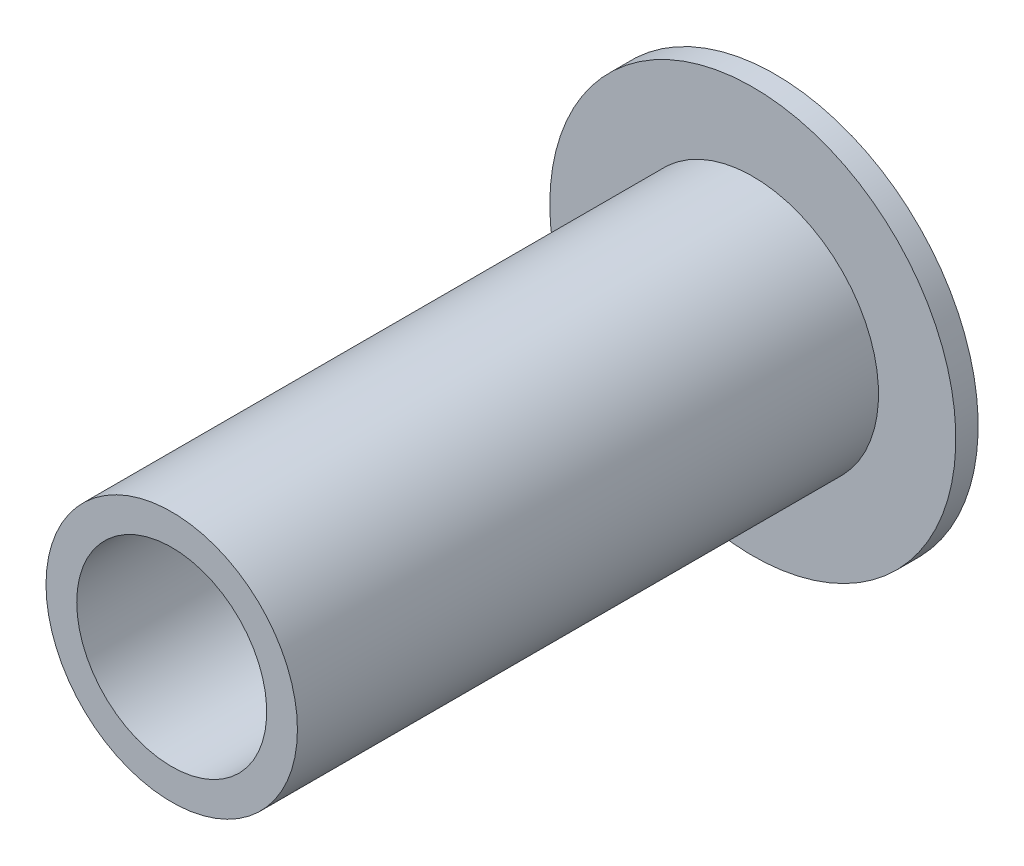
ISO-10303-21;
HEADER;
FILE_DESCRIPTION(('STEP AP214'),'2;1');
FILE_NAME('part.step','',(''),(''),'','','');
FILE_SCHEMA(('AUTOMOTIVE_DESIGN { 1 0 10303 214 1 1 1 1 }'));
ENDSEC;
DATA;
#1=APPLICATION_CONTEXT('core data for automotive mechanical design processes');
#2=APPLICATION_PROTOCOL_DEFINITION('international standard','automotive_design',2000,#1);
#3=PRODUCT_CONTEXT('',#1,'mechanical');
#4=PRODUCT('Part','Part','',(#3));
#5=PRODUCT_RELATED_PRODUCT_CATEGORY('part','',(#4));
#6=PRODUCT_DEFINITION_FORMATION('','',#4);
#7=PRODUCT_DEFINITION_CONTEXT('part definition',#1,'design');
#8=PRODUCT_DEFINITION('design','',#6,#7);
#9=PRODUCT_DEFINITION_SHAPE('','',#8);
#10=(LENGTH_UNIT() NAMED_UNIT(*) SI_UNIT(.MILLI.,.METRE.));
#11=(NAMED_UNIT(*) PLANE_ANGLE_UNIT() SI_UNIT($,.RADIAN.));
#12=(NAMED_UNIT(*) SI_UNIT($,.STERADIAN.) SOLID_ANGLE_UNIT());
#13=UNCERTAINTY_MEASURE_WITH_UNIT(LENGTH_MEASURE(1.E-05),#10,'distance_accuracy_value','');
#14=(GEOMETRIC_REPRESENTATION_CONTEXT(3) GLOBAL_UNCERTAINTY_ASSIGNED_CONTEXT((#13)) GLOBAL_UNIT_ASSIGNED_CONTEXT((#10,
#11,#12)) REPRESENTATION_CONTEXT('',''));
#15=CARTESIAN_POINT('',(0.,0.,0.));
#16=DIRECTION('',(0.,0.,1.));
#17=DIRECTION('',(1.,0.,0.));
#18=AXIS2_PLACEMENT_3D('',#15,#16,#17);
#19=CARTESIAN_POINT('',(0.,0.,-0.6));
#20=DIRECTION('',(0.,0.,-1.));
#21=DIRECTION('',(-1.,0.,0.));
#22=AXIS2_PLACEMENT_3D('',#19,#20,#21);
#23=PLANE('',#22);
#24=CARTESIAN_POINT('',(0.,0.,-0.6));
#25=DIRECTION('',(0.,0.,-1.));
#26=DIRECTION('',(-1.,0.,0.));
#27=AXIS2_PLACEMENT_3D('',#24,#25,#26);
#28=CIRCLE('',#27,5.45);
#29=CARTESIAN_POINT('',(-5.45,0.,-0.6));
#30=VERTEX_POINT('',#29);
#31=EDGE_CURVE('E46',#30,#30,#28,.T.);
#32=ORIENTED_EDGE('',*,*,#31,.T.);
#33=EDGE_LOOP('',(#32));
#34=FACE_BOUND('',#33,.T.);
#35=CARTESIAN_POINT('',(0.,0.,-0.6));
#36=DIRECTION('',(0.,0.,-1.));
#37=DIRECTION('',(-1.,0.,0.));
#38=AXIS2_PLACEMENT_3D('',#35,#36,#37);
#39=CIRCLE('',#38,3.5);
#40=CARTESIAN_POINT('',(-3.5,0.,-0.6));
#41=VERTEX_POINT('',#40);
#42=EDGE_CURVE('E52',#41,#41,#39,.T.);
#43=ORIENTED_EDGE('',*,*,#42,.F.);
#44=EDGE_LOOP('',(#43));
#45=FACE_BOUND('',#44,.T.);
#46=ADVANCED_FACE('F26',(#34,#45),#23,.T.);
#47=CARTESIAN_POINT('',(0.,0.,15.6));
#48=DIRECTION('',(0.,0.,-1.));
#49=DIRECTION('',(-1.,0.,0.));
#50=AXIS2_PLACEMENT_3D('',#47,#48,#49);
#51=CYLINDRICAL_SURFACE('',#50,3.375);
#52=CARTESIAN_POINT('',(0.,0.,15.6));
#53=DIRECTION('',(0.,0.,1.));
#54=DIRECTION('',(1.,0.,0.));
#55=AXIS2_PLACEMENT_3D('',#52,#53,#54);
#56=CIRCLE('',#55,3.375);
#57=CARTESIAN_POINT('',(3.375,0.,15.6));
#58=VERTEX_POINT('',#57);
#59=EDGE_CURVE('E37',#58,#58,#56,.T.);
#60=ORIENTED_EDGE('',*,*,#59,.F.);
#61=EDGE_LOOP('',(#60));
#62=FACE_BOUND('',#61,.T.);
#63=CARTESIAN_POINT('',(0.,0.,0.));
#64=DIRECTION('',(0.,0.,-1.));
#65=DIRECTION('',(-1.,0.,0.));
#66=AXIS2_PLACEMENT_3D('',#63,#64,#65);
#67=CIRCLE('',#66,3.375);
#68=CARTESIAN_POINT('',(-3.375,0.,0.));
#69=VERTEX_POINT('',#68);
#70=EDGE_CURVE('E41',#69,#69,#67,.T.);
#71=ORIENTED_EDGE('',*,*,#70,.F.);
#72=EDGE_LOOP('',(#71));
#73=FACE_BOUND('',#72,.T.);
#74=ADVANCED_FACE('F28',(#62,#73),#51,.T.);
#75=CARTESIAN_POINT('',(0.,0.,15.6));
#76=DIRECTION('',(0.,0.,1.));
#77=DIRECTION('',(1.,0.,0.));
#78=AXIS2_PLACEMENT_3D('',#75,#76,#77);
#79=PLANE('',#78);
#80=CARTESIAN_POINT('',(0.,0.,15.6));
#81=DIRECTION('',(0.,0.,-1.));
#82=DIRECTION('',(-1.,0.,0.));
#83=AXIS2_PLACEMENT_3D('',#80,#81,#82);
#84=CIRCLE('',#83,2.55);
#85=CARTESIAN_POINT('',(-2.55,0.,15.6));
#86=VERTEX_POINT('',#85);
#87=EDGE_CURVE('E55',#86,#86,#84,.T.);
#88=ORIENTED_EDGE('',*,*,#87,.T.);
#89=EDGE_LOOP('',(#88));
#90=FACE_BOUND('',#89,.T.);
#91=ORIENTED_EDGE('',*,*,#59,.T.);
#92=EDGE_LOOP('',(#91));
#93=FACE_BOUND('',#92,.T.);
#94=ADVANCED_FACE('F83',(#90,#93),#79,.T.);
#95=CARTESIAN_POINT('',(0.,0.,0.));
#96=DIRECTION('',(0.,0.,-1.));
#97=DIRECTION('',(-1.,0.,0.));
#98=AXIS2_PLACEMENT_3D('',#95,#96,#97);
#99=PLANE('',#98);
#100=CARTESIAN_POINT('',(0.,0.,0.));
#101=DIRECTION('',(0.,0.,-1.));
#102=DIRECTION('',(-1.,0.,0.));
#103=AXIS2_PLACEMENT_3D('',#100,#101,#102);
#104=CIRCLE('',#103,5.45);
#105=CARTESIAN_POINT('',(-5.45,0.,0.));
#106=VERTEX_POINT('',#105);
#107=EDGE_CURVE('E49',#106,#106,#104,.T.);
#108=ORIENTED_EDGE('',*,*,#107,.F.);
#109=EDGE_LOOP('',(#108));
#110=FACE_BOUND('',#109,.T.);
#111=ORIENTED_EDGE('',*,*,#70,.T.);
#112=EDGE_LOOP('',(#111));
#113=FACE_BOUND('',#112,.T.);
#114=ADVANCED_FACE('F88',(#110,#113),#99,.F.);
#115=CARTESIAN_POINT('',(0.,0.,-0.6));
#116=DIRECTION('',(0.,0.,1.));
#117=DIRECTION('',(1.,0.,0.));
#118=AXIS2_PLACEMENT_3D('',#115,#116,#117);
#119=CYLINDRICAL_SURFACE('',#118,5.45);
#120=ORIENTED_EDGE('',*,*,#31,.F.);
#121=EDGE_LOOP('',(#120));
#122=FACE_BOUND('',#121,.T.);
#123=ORIENTED_EDGE('',*,*,#107,.T.);
#124=EDGE_LOOP('',(#123));
#125=FACE_BOUND('',#124,.T.);
#126=ADVANCED_FACE('F75',(#122,#125),#119,.T.);
#127=CARTESIAN_POINT('',(0.,0.,-1.6));
#128=DIRECTION('',(0.,0.,1.));
#129=DIRECTION('',(1.,0.,0.));
#130=AXIS2_PLACEMENT_3D('',#127,#128,#129);
#131=CYLINDRICAL_SURFACE('',#130,3.5);
#132=CARTESIAN_POINT('',(0.,0.,-0.999999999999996));
#133=DIRECTION('',(0.,0.,-1.));
#134=DIRECTION('',(-1.,0.,0.));
#135=AXIS2_PLACEMENT_3D('',#132,#133,#134);
#136=CIRCLE('',#135,3.5);
#137=CARTESIAN_POINT('',(-3.5,0.,-0.999999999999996));
#138=VERTEX_POINT('',#137);
#139=EDGE_CURVE('E10',#138,#138,#136,.F.);
#140=ORIENTED_EDGE('',*,*,#139,.T.);
#141=EDGE_LOOP('',(#140));
#142=FACE_BOUND('',#141,.T.);
#143=ORIENTED_EDGE('',*,*,#42,.T.);
#144=EDGE_LOOP('',(#143));
#145=FACE_BOUND('',#144,.T.);
#146=ADVANCED_FACE('F66',(#142,#145),#131,.T.);
#147=CARTESIAN_POINT('',(0.,0.,-1.6));
#148=DIRECTION('',(0.,0.,-1.));
#149=DIRECTION('',(-1.,0.,0.));
#150=AXIS2_PLACEMENT_3D('',#147,#148,#149);
#151=PLANE('',#150);
#152=CARTESIAN_POINT('',(0.,0.,-1.6));
#153=DIRECTION('',(0.,0.,-1.));
#154=DIRECTION('',(-1.,0.,0.));
#155=AXIS2_PLACEMENT_3D('',#152,#153,#154);
#156=CIRCLE('',#155,2.89999999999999);
#157=CARTESIAN_POINT('',(-2.89999999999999,0.,-1.6));
#158=VERTEX_POINT('',#157);
#159=EDGE_CURVE('E33',#158,#158,#156,.T.);
#160=ORIENTED_EDGE('',*,*,#159,.T.);
#161=EDGE_LOOP('',(#160));
#162=FACE_BOUND('',#161,.T.);
#163=CARTESIAN_POINT('',(0.,0.,-1.6));
#164=DIRECTION('',(0.,0.,-1.));
#165=DIRECTION('',(-1.,0.,0.));
#166=AXIS2_PLACEMENT_3D('',#163,#164,#165);
#167=CIRCLE('',#166,2.55);
#168=CARTESIAN_POINT('',(-2.55,0.,-1.6));
#169=VERTEX_POINT('',#168);
#170=EDGE_CURVE('E58',#169,#169,#167,.T.);
#171=ORIENTED_EDGE('',*,*,#170,.F.);
#172=EDGE_LOOP('',(#171));
#173=FACE_BOUND('',#172,.T.);
#174=ADVANCED_FACE('F64',(#162,#173),#151,.T.);
#175=CARTESIAN_POINT('',(0.,0.,15.6));
#176=DIRECTION('',(0.,0.,-1.));
#177=DIRECTION('',(-1.,0.,0.));
#178=AXIS2_PLACEMENT_3D('',#175,#176,#177);
#179=CYLINDRICAL_SURFACE('',#178,2.55);
#180=CARTESIAN_POINT('',(-2.55,0.,15.6));
#181=CARTESIAN_POINT('',(-2.55,0.,15.4208333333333));
#182=CARTESIAN_POINT('',(-2.55,0.,15.2416666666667));
#183=CARTESIAN_POINT('',(-2.55,0.,14.8833333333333));
#184=CARTESIAN_POINT('',(-2.55,0.,14.7041666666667));
#185=CARTESIAN_POINT('',(-2.55,0.,14.3458333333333));
#186=CARTESIAN_POINT('',(-2.55,0.,14.1666666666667));
#187=CARTESIAN_POINT('',(-2.55,0.,13.8083333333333));
#188=CARTESIAN_POINT('',(-2.55,0.,13.6291666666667));
#189=CARTESIAN_POINT('',(-2.55,0.,13.2708333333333));
#190=CARTESIAN_POINT('',(-2.55,0.,13.0916666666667));
#191=CARTESIAN_POINT('',(-2.55,0.,12.7333333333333));
#192=CARTESIAN_POINT('',(-2.55,0.,12.5541666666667));
#193=CARTESIAN_POINT('',(-2.55,0.,12.1958333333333));
#194=CARTESIAN_POINT('',(-2.55,0.,12.0166666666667));
#195=CARTESIAN_POINT('',(-2.55,0.,11.6583333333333));
#196=CARTESIAN_POINT('',(-2.55,0.,11.4791666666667));
#197=CARTESIAN_POINT('',(-2.55,0.,11.1208333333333));
#198=CARTESIAN_POINT('',(-2.55,0.,10.9416666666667));
#199=CARTESIAN_POINT('',(-2.55,0.,10.5833333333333));
#200=CARTESIAN_POINT('',(-2.55,0.,10.4041666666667));
#201=CARTESIAN_POINT('',(-2.55,0.,10.0458333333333));
#202=CARTESIAN_POINT('',(-2.55,0.,9.86666666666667));
#203=CARTESIAN_POINT('',(-2.55,0.,9.50833333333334));
#204=CARTESIAN_POINT('',(-2.55,0.,9.32916666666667));
#205=CARTESIAN_POINT('',(-2.55,0.,8.97083333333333));
#206=CARTESIAN_POINT('',(-2.55,0.,8.79166666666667));
#207=CARTESIAN_POINT('',(-2.55,0.,8.43333333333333));
#208=CARTESIAN_POINT('',(-2.55,0.,8.25416666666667));
#209=CARTESIAN_POINT('',(-2.55,0.,7.89583333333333));
#210=CARTESIAN_POINT('',(-2.55,0.,7.71666666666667));
#211=CARTESIAN_POINT('',(-2.55,0.,7.35833333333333));
#212=CARTESIAN_POINT('',(-2.55,0.,7.17916666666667));
#213=CARTESIAN_POINT('',(-2.55,0.,6.82083333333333));
#214=CARTESIAN_POINT('',(-2.55,0.,6.64166666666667));
#215=CARTESIAN_POINT('',(-2.55,0.,6.28333333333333));
#216=CARTESIAN_POINT('',(-2.55,0.,6.10416666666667));
#217=CARTESIAN_POINT('',(-2.55,0.,5.74583333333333));
#218=CARTESIAN_POINT('',(-2.55,0.,5.56666666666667));
#219=CARTESIAN_POINT('',(-2.55,0.,5.20833333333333));
#220=CARTESIAN_POINT('',(-2.55,0.,5.02916666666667));
#221=CARTESIAN_POINT('',(-2.55,0.,4.67083333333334));
#222=CARTESIAN_POINT('',(-2.55,0.,4.49166666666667));
#223=CARTESIAN_POINT('',(-2.55,0.,4.13333333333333));
#224=CARTESIAN_POINT('',(-2.55,0.,3.95416666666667));
#225=CARTESIAN_POINT('',(-2.55,0.,3.59583333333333));
#226=CARTESIAN_POINT('',(-2.55,0.,3.41666666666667));
#227=CARTESIAN_POINT('',(-2.55,0.,3.05833333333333));
#228=CARTESIAN_POINT('',(-2.55,0.,2.87916666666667));
#229=CARTESIAN_POINT('',(-2.55,0.,2.52083333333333));
#230=CARTESIAN_POINT('',(-2.55,0.,2.34166666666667));
#231=CARTESIAN_POINT('',(-2.55,0.,1.98333333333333));
#232=CARTESIAN_POINT('',(-2.55,0.,1.80416666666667));
#233=CARTESIAN_POINT('',(-2.55,0.,1.44583333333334));
#234=CARTESIAN_POINT('',(-2.55,0.,1.26666666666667));
#235=CARTESIAN_POINT('',(-2.55,0.,0.908333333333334));
#236=CARTESIAN_POINT('',(-2.55,0.,0.729166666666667));
#237=CARTESIAN_POINT('',(-2.55,0.,0.370833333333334));
#238=CARTESIAN_POINT('',(-2.55,0.,0.191666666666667));
#239=CARTESIAN_POINT('',(-2.55,0.,-0.166666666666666));
#240=CARTESIAN_POINT('',(-2.55,0.,-0.345833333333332));
#241=CARTESIAN_POINT('',(-2.55,0.,-0.704166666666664));
#242=CARTESIAN_POINT('',(-2.55,0.,-0.883333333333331));
#243=CARTESIAN_POINT('',(-2.55,0.,-1.24166666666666));
#244=CARTESIAN_POINT('',(-2.55,0.,-1.42083333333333));
#245=CARTESIAN_POINT('',(-2.55,0.,-1.6));
#246=B_SPLINE_CURVE_WITH_KNOTS('',3,(#180,#181,#182,#183,#184,#185,#186,#187,#188,#189,#190,
#191,#192,#193,#194,#195,#196,#197,#198,#199,#200,#201,#202,#203,#204,#205,#206,#207,#208,#209,
#210,#211,#212,#213,#214,#215,#216,#217,#218,#219,#220,#221,#222,#223,#224,#225,#226,#227,#228,
#229,#230,#231,#232,#233,#234,#235,#236,#237,#238,#239,#240,#241,#242,#243,#244,#245),
.UNSPECIFIED.,.F.,.F.,(4,2,2,2,2,2,2,2,2,2,2,2,2,2,2,2,2,2,2,2,2,2,2,2,2,2,2,2,2,2,2,2,4),(0.,
0.5375,1.075,1.6125,2.15,2.6875,3.225,3.7625,4.3,4.8375,5.375,5.9125,6.45,6.9875,7.525,8.0625,
8.6,9.1375,9.675,10.2125,10.75,11.2875,11.825,12.3625,12.9,13.4375,13.975,14.5125,15.05,15.5875,
16.125,16.6625,17.2),.UNSPECIFIED.);
#247=EDGE_CURVE('BSEAM62',#86,#169,#246,.T.);
#248=ORIENTED_EDGE('',*,*,#87,.F.);
#249=ORIENTED_EDGE('',*,*,#170,.T.);
#250=ORIENTED_EDGE('',*,*,#247,.T.);
#251=ORIENTED_EDGE('',*,*,#247,.F.);
#252=EDGE_LOOP('',(#248,#250,#249,#251));
#253=FACE_BOUND('',#252,.T.);
#254=ADVANCED_FACE('F62',(#253),#179,.F.);
#255=CARTESIAN_POINT('',(0.,0.,-1.6));
#256=DIRECTION('',(0.,0.,1.));
#257=DIRECTION('',(1.,0.,0.));
#258=AXIS2_PLACEMENT_3D('',#255,#256,#257);
#259=CONICAL_SURFACE('',#258,2.89999999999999,0.785398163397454);
#260=ORIENTED_EDGE('',*,*,#139,.F.);
#261=EDGE_LOOP('',(#260));
#262=FACE_BOUND('',#261,.T.);
#263=ORIENTED_EDGE('',*,*,#159,.F.);
#264=EDGE_LOOP('',(#263));
#265=FACE_BOUND('',#264,.T.);
#266=ADVANCED_FACE('F72',(#262,#265),#259,.T.);
#267=CLOSED_SHELL('',(#46,#74,#94,#114,#126,#146,#174,#254,#266));
#268=MANIFOLD_SOLID_BREP('B2',#267);
#269=ADVANCED_BREP_SHAPE_REPRESENTATION('',(#18,#268),#14);
#270=SHAPE_DEFINITION_REPRESENTATION(#9,#269);
ENDSEC;
END-ISO-10303-21;
